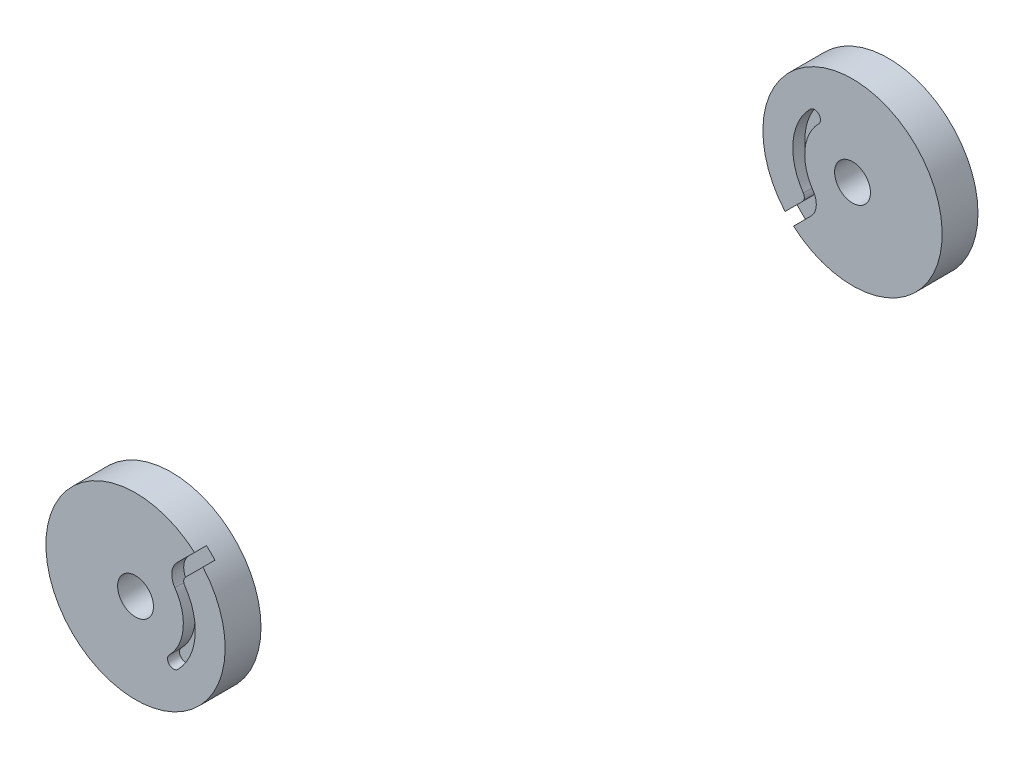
ISO-10303-21;
HEADER;
FILE_DESCRIPTION(('STEP AP214'),'2;1');
FILE_NAME('part.step','',(''),(''),'','','');
FILE_SCHEMA(('AUTOMOTIVE_DESIGN { 1 0 10303 214 1 1 1 1 }'));
ENDSEC;
DATA;
#1=APPLICATION_CONTEXT('core data for automotive mechanical design processes');
#2=APPLICATION_PROTOCOL_DEFINITION('international standard','automotive_design',2000,#1);
#3=PRODUCT_CONTEXT('',#1,'mechanical');
#4=PRODUCT('Part','Part','',(#3));
#5=PRODUCT_RELATED_PRODUCT_CATEGORY('part','',(#4));
#6=PRODUCT_DEFINITION_FORMATION('','',#4);
#7=PRODUCT_DEFINITION_CONTEXT('part definition',#1,'design');
#8=PRODUCT_DEFINITION('design','',#6,#7);
#9=PRODUCT_DEFINITION_SHAPE('','',#8);
#10=(LENGTH_UNIT() NAMED_UNIT(*) SI_UNIT(.MILLI.,.METRE.));
#11=(NAMED_UNIT(*) PLANE_ANGLE_UNIT() SI_UNIT($,.RADIAN.));
#12=(NAMED_UNIT(*) SI_UNIT($,.STERADIAN.) SOLID_ANGLE_UNIT());
#13=UNCERTAINTY_MEASURE_WITH_UNIT(LENGTH_MEASURE(1.E-05),#10,'distance_accuracy_value','');
#14=(GEOMETRIC_REPRESENTATION_CONTEXT(3) GLOBAL_UNCERTAINTY_ASSIGNED_CONTEXT((#13)) GLOBAL_UNIT_ASSIGNED_CONTEXT((#10,
#11,#12)) REPRESENTATION_CONTEXT('',''));
#15=CARTESIAN_POINT('',(0.,0.,0.));
#16=DIRECTION('',(0.,0.,1.));
#17=DIRECTION('',(1.,0.,0.));
#18=AXIS2_PLACEMENT_3D('',#15,#16,#17);
#19=CARTESIAN_POINT('',(120.,120.,6.));
#20=DIRECTION('',(0.,0.,1.));
#21=DIRECTION('',(1.,0.,0.));
#22=AXIS2_PLACEMENT_3D('',#19,#20,#21);
#23=PLANE('',#22);
#24=DIRECTION('',(0.707106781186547,0.707106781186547,0.));
#25=VECTOR('',#24,1.);
#26=CARTESIAN_POINT('',(113.058577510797,111.644363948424,6.));
#27=LINE('',#26,#25);
#28=CARTESIAN_POINT('',(110.124101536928,108.709887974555,6.));
#29=VERTEX_POINT('',#28);
#30=CARTESIAN_POINT('',(113.058577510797,111.644363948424,6.));
#31=VERTEX_POINT('',#30);
#32=EDGE_CURVE('E123',#29,#31,#27,.T.);
#33=ORIENTED_EDGE('',*,*,#32,.F.);
#34=CARTESIAN_POINT('',(120.,120.,6.));
#35=DIRECTION('',(0.,0.,1.));
#36=DIRECTION('',(1.,0.,0.));
#37=AXIS2_PLACEMENT_3D('',#34,#35,#36);
#38=CIRCLE('',#37,15.);
#39=CARTESIAN_POINT('',(108.709887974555,110.124101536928,6.));
#40=VERTEX_POINT('',#39);
#41=EDGE_CURVE('E122',#29,#40,#38,.T.);
#42=ORIENTED_EDGE('',*,*,#41,.T.);
#43=DIRECTION('',(-0.707106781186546,-0.707106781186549,0.));
#44=VECTOR('',#43,1.);
#45=CARTESIAN_POINT('',(107.355586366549,108.769799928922,6.));
#46=LINE('',#45,#44);
#47=CARTESIAN_POINT('',(111.644363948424,113.058577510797,6.));
#48=VERTEX_POINT('',#47);
#49=EDGE_CURVE('E103',#48,#40,#46,.T.);
#50=ORIENTED_EDGE('',*,*,#49,.F.);
#51=CARTESIAN_POINT('',(110.937257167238,113.765684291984,6.));
#52=DIRECTION('',(0.,0.,-1.));
#53=DIRECTION('',(-1.,0.,0.));
#54=AXIS2_PLACEMENT_3D('',#51,#52,#53);
#55=CIRCLE('',#54,0.999999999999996);
#56=CARTESIAN_POINT('',(111.761142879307,114.33244026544,6.));
#57=VERTEX_POINT('',#56);
#58=EDGE_CURVE('E111',#57,#48,#55,.T.);
#59=ORIENTED_EDGE('',*,*,#58,.F.);
#60=CARTESIAN_POINT('',(120.,120.,6.));
#61=DIRECTION('',(0.,0.,1.));
#62=DIRECTION('',(1.,0.,0.));
#63=AXIS2_PLACEMENT_3D('',#60,#61,#62);
#64=CIRCLE('',#63,10.);
#65=CARTESIAN_POINT('',(112.928932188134,127.071067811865,6.));
#66=VERTEX_POINT('',#65);
#67=EDGE_CURVE('E136',#66,#57,#64,.T.);
#68=ORIENTED_EDGE('',*,*,#67,.F.);
#69=CARTESIAN_POINT('',(113.636038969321,126.363961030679,6.));
#70=DIRECTION('',(0.,0.,1.));
#71=DIRECTION('',(-1.,0.,0.));
#72=AXIS2_PLACEMENT_3D('',#69,#70,#71);
#73=CIRCLE('',#72,1.);
#74=CARTESIAN_POINT('',(114.343145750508,125.656854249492,6.));
#75=VERTEX_POINT('',#74);
#76=EDGE_CURVE('E133',#75,#66,#73,.T.);
#77=ORIENTED_EDGE('',*,*,#76,.F.);
#78=CARTESIAN_POINT('',(120.,120.,6.));
#79=DIRECTION('',(0.,0.,-1.));
#80=DIRECTION('',(1.,0.,0.));
#81=AXIS2_PLACEMENT_3D('',#78,#79,#80);
#82=CIRCLE('',#81,7.99999999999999);
#83=CARTESIAN_POINT('',(113.408914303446,115.465952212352,6.));
#84=VERTEX_POINT('',#83);
#85=EDGE_CURVE('E130',#84,#75,#82,.T.);
#86=ORIENTED_EDGE('',*,*,#85,.F.);
#87=CARTESIAN_POINT('',(110.937257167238,113.765684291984,6.));
#88=DIRECTION('',(0.,0.,1.));
#89=DIRECTION('',(1.,0.,0.));
#90=AXIS2_PLACEMENT_3D('',#87,#88,#89);
#91=CIRCLE('',#90,2.99999999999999);
#92=EDGE_CURVE('E125',#31,#84,#91,.T.);
#93=ORIENTED_EDGE('',*,*,#92,.F.);
#94=EDGE_LOOP('',(#33,#42,#50,#59,#68,#77,#86,#93));
#95=FACE_BOUND('',#94,.T.);
#96=CARTESIAN_POINT('',(120.,120.,6.));
#97=DIRECTION('',(0.,0.,1.));
#98=DIRECTION('',(1.,0.,0.));
#99=AXIS2_PLACEMENT_3D('',#96,#97,#98);
#100=CIRCLE('',#99,3.00000000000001);
#101=CARTESIAN_POINT('',(123.,120.,6.));
#102=VERTEX_POINT('',#101);
#103=EDGE_CURVE('E166',#102,#102,#100,.T.);
#104=ORIENTED_EDGE('',*,*,#103,.F.);
#105=EDGE_LOOP('',(#104));
#106=FACE_BOUND('',#105,.T.);
#107=ADVANCED_FACE('F36',(#95,#106),#23,.T.);
#108=CARTESIAN_POINT('',(120.,120.,0.));
#109=DIRECTION('',(0.,0.,1.));
#110=DIRECTION('',(1.,0.,0.));
#111=AXIS2_PLACEMENT_3D('',#108,#109,#110);
#112=PLANE('',#111);
#113=CARTESIAN_POINT('',(120.,120.,0.));
#114=DIRECTION('',(0.,0.,1.));
#115=DIRECTION('',(1.,0.,0.));
#116=AXIS2_PLACEMENT_3D('',#113,#114,#115);
#117=CIRCLE('',#116,15.);
#118=CARTESIAN_POINT('',(135.,120.,0.));
#119=VERTEX_POINT('',#118);
#120=EDGE_CURVE('E169',#119,#119,#117,.T.);
#121=ORIENTED_EDGE('',*,*,#120,.F.);
#122=EDGE_LOOP('',(#121));
#123=FACE_BOUND('',#122,.T.);
#124=CARTESIAN_POINT('',(120.,120.,0.));
#125=DIRECTION('',(0.,0.,1.));
#126=DIRECTION('',(1.,0.,0.));
#127=AXIS2_PLACEMENT_3D('',#124,#125,#126);
#128=CIRCLE('',#127,3.00000000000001);
#129=CARTESIAN_POINT('',(123.,120.,0.));
#130=VERTEX_POINT('',#129);
#131=EDGE_CURVE('E155',#130,#130,#128,.T.);
#132=ORIENTED_EDGE('',*,*,#131,.T.);
#133=EDGE_LOOP('',(#132));
#134=FACE_BOUND('',#133,.T.);
#135=ADVANCED_FACE('F204',(#123,#134),#112,.F.);
#136=CARTESIAN_POINT('',(120.,120.,6.));
#137=DIRECTION('',(0.,0.,-1.));
#138=DIRECTION('',(-1.,0.,0.));
#139=AXIS2_PLACEMENT_3D('',#136,#137,#138);
#140=CYLINDRICAL_SURFACE('',#139,15.);
#141=ORIENTED_EDGE('',*,*,#41,.F.);
#142=DIRECTION('',(0.,0.,-1.));
#143=VECTOR('',#142,1.);
#144=CARTESIAN_POINT('',(110.124101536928,108.709887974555,6.));
#145=LINE('',#144,#143);
#146=CARTESIAN_POINT('',(110.124101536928,108.709887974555,4.));
#147=VERTEX_POINT('',#146);
#148=EDGE_CURVE('E12',#29,#147,#145,.T.);
#149=ORIENTED_EDGE('',*,*,#148,.T.);
#150=CARTESIAN_POINT('',(120.,120.,4.));
#151=DIRECTION('',(0.,0.,-1.));
#152=DIRECTION('',(-1.,0.,0.));
#153=AXIS2_PLACEMENT_3D('',#150,#151,#152);
#154=CIRCLE('',#153,15.);
#155=CARTESIAN_POINT('',(108.709887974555,110.124101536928,4.));
#156=VERTEX_POINT('',#155);
#157=EDGE_CURVE('E56',#147,#156,#154,.T.);
#158=ORIENTED_EDGE('',*,*,#157,.T.);
#159=DIRECTION('',(0.,0.,-1.));
#160=VECTOR('',#159,1.);
#161=CARTESIAN_POINT('',(108.709887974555,110.124101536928,6.));
#162=LINE('',#161,#160);
#163=EDGE_CURVE('E44',#156,#40,#162,.F.);
#164=ORIENTED_EDGE('',*,*,#163,.T.);
#165=EDGE_LOOP('',(#141,#149,#158,#164));
#166=FACE_BOUND('',#165,.T.);
#167=ORIENTED_EDGE('',*,*,#120,.T.);
#168=EDGE_LOOP('',(#167));
#169=FACE_BOUND('',#168,.T.);
#170=ADVANCED_FACE('F38',(#166,#169),#140,.T.);
#171=CARTESIAN_POINT('',(120.,120.,6.));
#172=DIRECTION('',(0.,0.,-1.));
#173=DIRECTION('',(-1.,0.,0.));
#174=AXIS2_PLACEMENT_3D('',#171,#172,#173);
#175=CYLINDRICAL_SURFACE('',#174,3.00000000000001);
#176=ORIENTED_EDGE('',*,*,#103,.T.);
#177=EDGE_LOOP('',(#176));
#178=FACE_BOUND('',#177,.T.);
#179=ORIENTED_EDGE('',*,*,#131,.F.);
#180=EDGE_LOOP('',(#179));
#181=FACE_BOUND('',#180,.T.);
#182=ADVANCED_FACE('F213',(#178,#181),#175,.F.);
#183=CARTESIAN_POINT('',(113.058577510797,111.644363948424,4.));
#184=DIRECTION('',(0.707106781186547,-0.707106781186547,0.));
#185=DIRECTION('',(0.707106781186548,0.707106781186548,0.));
#186=AXIS2_PLACEMENT_3D('',#183,#184,#185);
#187=PLANE('',#186);
#188=ORIENTED_EDGE('',*,*,#32,.T.);
#189=DIRECTION('',(0.,0.,1.));
#190=VECTOR('',#189,1.);
#191=CARTESIAN_POINT('',(113.058577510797,111.644363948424,4.));
#192=LINE('',#191,#190);
#193=CARTESIAN_POINT('',(113.058577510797,111.644363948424,4.));
#194=VERTEX_POINT('',#193);
#195=EDGE_CURVE('E107',#194,#31,#192,.T.);
#196=ORIENTED_EDGE('',*,*,#195,.F.);
#197=DIRECTION('',(0.707106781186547,0.707106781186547,0.));
#198=VECTOR('',#197,1.);
#199=CARTESIAN_POINT('',(113.058577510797,111.644363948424,4.));
#200=LINE('',#199,#198);
#201=EDGE_CURVE('E141',#147,#194,#200,.T.);
#202=ORIENTED_EDGE('',*,*,#201,.F.);
#203=ORIENTED_EDGE('',*,*,#148,.F.);
#204=EDGE_LOOP('',(#188,#196,#202,#203));
#205=FACE_BOUND('',#204,.T.);
#206=ADVANCED_FACE('F176',(#205),#187,.F.);
#207=CARTESIAN_POINT('',(107.355586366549,108.769799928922,4.));
#208=DIRECTION('',(-0.707106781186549,0.707106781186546,0.));
#209=DIRECTION('',(-0.707106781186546,-0.707106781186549,0.));
#210=AXIS2_PLACEMENT_3D('',#207,#208,#209);
#211=PLANE('',#210);
#212=DIRECTION('',(-0.707106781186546,-0.707106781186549,0.));
#213=VECTOR('',#212,1.);
#214=CARTESIAN_POINT('',(107.355586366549,108.769799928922,4.));
#215=LINE('',#214,#213);
#216=CARTESIAN_POINT('',(111.644363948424,113.058577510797,4.));
#217=VERTEX_POINT('',#216);
#218=EDGE_CURVE('E51',#217,#156,#215,.T.);
#219=ORIENTED_EDGE('',*,*,#218,.F.);
#220=DIRECTION('',(0.,0.,1.));
#221=VECTOR('',#220,1.);
#222=CARTESIAN_POINT('',(111.644363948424,113.058577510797,4.));
#223=LINE('',#222,#221);
#224=EDGE_CURVE('E99',#217,#48,#223,.T.);
#225=ORIENTED_EDGE('',*,*,#224,.T.);
#226=ORIENTED_EDGE('',*,*,#49,.T.);
#227=ORIENTED_EDGE('',*,*,#163,.F.);
#228=EDGE_LOOP('',(#219,#225,#226,#227));
#229=FACE_BOUND('',#228,.T.);
#230=ADVANCED_FACE('F101',(#229),#211,.F.);
#231=CARTESIAN_POINT('',(110.937257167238,113.765684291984,4.));
#232=DIRECTION('',(0.,0.,-1.));
#233=DIRECTION('',(-1.,0.,0.));
#234=AXIS2_PLACEMENT_3D('',#231,#232,#233);
#235=PLANE('',#234);
#236=ORIENTED_EDGE('',*,*,#201,.T.);
#237=CARTESIAN_POINT('',(110.937257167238,113.765684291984,4.));
#238=DIRECTION('',(0.,0.,1.));
#239=DIRECTION('',(1.,0.,0.));
#240=AXIS2_PLACEMENT_3D('',#237,#238,#239);
#241=CIRCLE('',#240,2.99999999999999);
#242=CARTESIAN_POINT('',(113.408914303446,115.465952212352,4.));
#243=VERTEX_POINT('',#242);
#244=EDGE_CURVE('E143',#194,#243,#241,.T.);
#245=ORIENTED_EDGE('',*,*,#244,.T.);
#246=CARTESIAN_POINT('',(120.,120.,4.));
#247=DIRECTION('',(0.,0.,-1.));
#248=DIRECTION('',(1.,0.,0.));
#249=AXIS2_PLACEMENT_3D('',#246,#247,#248);
#250=CIRCLE('',#249,7.99999999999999);
#251=CARTESIAN_POINT('',(114.343145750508,125.656854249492,4.));
#252=VERTEX_POINT('',#251);
#253=EDGE_CURVE('E146',#243,#252,#250,.T.);
#254=ORIENTED_EDGE('',*,*,#253,.T.);
#255=CARTESIAN_POINT('',(113.636038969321,126.363961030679,4.));
#256=DIRECTION('',(0.,0.,1.));
#257=DIRECTION('',(-1.,0.,0.));
#258=AXIS2_PLACEMENT_3D('',#255,#256,#257);
#259=CIRCLE('',#258,1.);
#260=CARTESIAN_POINT('',(112.928932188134,127.071067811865,4.));
#261=VERTEX_POINT('',#260);
#262=EDGE_CURVE('E149',#252,#261,#259,.T.);
#263=ORIENTED_EDGE('',*,*,#262,.T.);
#264=CARTESIAN_POINT('',(120.,120.,4.));
#265=DIRECTION('',(0.,0.,1.));
#266=DIRECTION('',(1.,0.,0.));
#267=AXIS2_PLACEMENT_3D('',#264,#265,#266);
#268=CIRCLE('',#267,10.);
#269=CARTESIAN_POINT('',(111.761142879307,114.33244026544,4.));
#270=VERTEX_POINT('',#269);
#271=EDGE_CURVE('E108',#261,#270,#268,.T.);
#272=ORIENTED_EDGE('',*,*,#271,.T.);
#273=CARTESIAN_POINT('',(110.937257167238,113.765684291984,4.));
#274=DIRECTION('',(0.,0.,-1.));
#275=DIRECTION('',(-1.,0.,0.));
#276=AXIS2_PLACEMENT_3D('',#273,#274,#275);
#277=CIRCLE('',#276,0.999999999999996);
#278=EDGE_CURVE('E138',#270,#217,#277,.T.);
#279=ORIENTED_EDGE('',*,*,#278,.T.);
#280=ORIENTED_EDGE('',*,*,#218,.T.);
#281=ORIENTED_EDGE('',*,*,#157,.F.);
#282=EDGE_LOOP('',(#236,#245,#254,#263,#272,#279,#280,#281));
#283=FACE_BOUND('',#282,.T.);
#284=ADVANCED_FACE('F185',(#283),#235,.F.);
#285=CARTESIAN_POINT('',(110.937257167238,113.765684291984,4.));
#286=DIRECTION('',(0.,0.,1.));
#287=DIRECTION('',(1.,0.,0.));
#288=AXIS2_PLACEMENT_3D('',#285,#286,#287);
#289=CYLINDRICAL_SURFACE('',#288,0.999999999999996);
#290=ORIENTED_EDGE('',*,*,#58,.T.);
#291=ORIENTED_EDGE('',*,*,#224,.F.);
#292=ORIENTED_EDGE('',*,*,#278,.F.);
#293=DIRECTION('',(0.,0.,1.));
#294=VECTOR('',#293,1.);
#295=CARTESIAN_POINT('',(111.761142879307,114.33244026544,4.));
#296=LINE('',#295,#294);
#297=EDGE_CURVE('E113',#270,#57,#296,.T.);
#298=ORIENTED_EDGE('',*,*,#297,.T.);
#299=EDGE_LOOP('',(#290,#291,#292,#298));
#300=FACE_BOUND('',#299,.T.);
#301=ADVANCED_FACE('F112',(#300),#289,.T.);
#302=CARTESIAN_POINT('',(120.,120.,4.));
#303=DIRECTION('',(0.,0.,1.));
#304=DIRECTION('',(1.,0.,0.));
#305=AXIS2_PLACEMENT_3D('',#302,#303,#304);
#306=CYLINDRICAL_SURFACE('',#305,10.);
#307=ORIENTED_EDGE('',*,*,#67,.T.);
#308=ORIENTED_EDGE('',*,*,#297,.F.);
#309=ORIENTED_EDGE('',*,*,#271,.F.);
#310=DIRECTION('',(0.,0.,1.));
#311=VECTOR('',#310,1.);
#312=CARTESIAN_POINT('',(112.928932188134,127.071067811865,4.));
#313=LINE('',#312,#311);
#314=EDGE_CURVE('E156',#261,#66,#313,.T.);
#315=ORIENTED_EDGE('',*,*,#314,.T.);
#316=EDGE_LOOP('',(#307,#308,#309,#315));
#317=FACE_BOUND('',#316,.T.);
#318=ADVANCED_FACE('F193',(#317),#306,.F.);
#319=CARTESIAN_POINT('',(113.636038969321,126.363961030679,4.));
#320=DIRECTION('',(0.,0.,1.));
#321=DIRECTION('',(1.,0.,0.));
#322=AXIS2_PLACEMENT_3D('',#319,#320,#321);
#323=CYLINDRICAL_SURFACE('',#322,1.);
#324=ORIENTED_EDGE('',*,*,#76,.T.);
#325=ORIENTED_EDGE('',*,*,#314,.F.);
#326=ORIENTED_EDGE('',*,*,#262,.F.);
#327=DIRECTION('',(0.,0.,1.));
#328=VECTOR('',#327,1.);
#329=CARTESIAN_POINT('',(114.343145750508,125.656854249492,4.));
#330=LINE('',#329,#328);
#331=EDGE_CURVE('E158',#252,#75,#330,.T.);
#332=ORIENTED_EDGE('',*,*,#331,.T.);
#333=EDGE_LOOP('',(#324,#325,#326,#332));
#334=FACE_BOUND('',#333,.T.);
#335=ADVANCED_FACE('F191',(#334),#323,.F.);
#336=CARTESIAN_POINT('',(120.,120.,4.));
#337=DIRECTION('',(0.,0.,1.));
#338=DIRECTION('',(1.,0.,0.));
#339=AXIS2_PLACEMENT_3D('',#336,#337,#338);
#340=CYLINDRICAL_SURFACE('',#339,7.99999999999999);
#341=ORIENTED_EDGE('',*,*,#85,.T.);
#342=ORIENTED_EDGE('',*,*,#331,.F.);
#343=ORIENTED_EDGE('',*,*,#253,.F.);
#344=DIRECTION('',(0.,0.,1.));
#345=VECTOR('',#344,1.);
#346=CARTESIAN_POINT('',(113.408914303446,115.465952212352,4.));
#347=LINE('',#346,#345);
#348=EDGE_CURVE('E160',#243,#84,#347,.T.);
#349=ORIENTED_EDGE('',*,*,#348,.T.);
#350=EDGE_LOOP('',(#341,#342,#343,#349));
#351=FACE_BOUND('',#350,.T.);
#352=ADVANCED_FACE('F189',(#351),#340,.T.);
#353=CARTESIAN_POINT('',(110.937257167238,113.765684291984,4.));
#354=DIRECTION('',(0.,0.,1.));
#355=DIRECTION('',(1.,0.,0.));
#356=AXIS2_PLACEMENT_3D('',#353,#354,#355);
#357=CYLINDRICAL_SURFACE('',#356,2.99999999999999);
#358=ORIENTED_EDGE('',*,*,#92,.T.);
#359=ORIENTED_EDGE('',*,*,#348,.F.);
#360=ORIENTED_EDGE('',*,*,#244,.F.);
#361=ORIENTED_EDGE('',*,*,#195,.T.);
#362=EDGE_LOOP('',(#358,#359,#360,#361));
#363=FACE_BOUND('',#362,.T.);
#364=ADVANCED_FACE('F182',(#363),#357,.F.);
#365=CLOSED_SHELL('',(#107,#135,#170,#182,#206,#230,#284,#301,#318,#335,#352,#364));
#366=MANIFOLD_SOLID_BREP('B2',#365);
#367=CARTESIAN_POINT('',(0.,0.,6.));
#368=DIRECTION('',(0.,0.,1.));
#369=DIRECTION('',(1.,0.,0.));
#370=AXIS2_PLACEMENT_3D('',#367,#368,#369);
#371=PLANE('',#370);
#372=DIRECTION('',(-0.707106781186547,-0.707106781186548,0.));
#373=VECTOR('',#372,1.);
#374=CARTESIAN_POINT('',(6.94142248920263,8.35563605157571,6.));
#375=LINE('',#374,#373);
#376=CARTESIAN_POINT('',(9.87589846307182,11.2901120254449,6.));
#377=VERTEX_POINT('',#376);
#378=CARTESIAN_POINT('',(6.94142248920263,8.35563605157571,6.));
#379=VERTEX_POINT('',#378);
#380=EDGE_CURVE('E362',#377,#379,#375,.T.);
#381=ORIENTED_EDGE('',*,*,#380,.F.);
#382=CARTESIAN_POINT('',(0.,0.,6.));
#383=DIRECTION('',(0.,0.,1.));
#384=DIRECTION('',(1.,0.,0.));
#385=AXIS2_PLACEMENT_3D('',#382,#383,#384);
#386=CIRCLE('',#385,15.);
#387=CARTESIAN_POINT('',(11.2901120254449,9.87589846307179,6.));
#388=VERTEX_POINT('',#387);
#389=EDGE_CURVE('E361',#377,#388,#386,.T.);
#390=ORIENTED_EDGE('',*,*,#389,.T.);
#391=DIRECTION('',(0.707106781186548,0.707106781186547,0.));
#392=VECTOR('',#391,1.);
#393=CARTESIAN_POINT('',(12.5831905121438,11.1689769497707,6.));
#394=LINE('',#393,#392);
#395=CARTESIAN_POINT('',(8.35563605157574,6.9414224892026,6.));
#396=VERTEX_POINT('',#395);
#397=EDGE_CURVE('E342',#396,#388,#394,.T.);
#398=ORIENTED_EDGE('',*,*,#397,.F.);
#399=CARTESIAN_POINT('',(9.06274283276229,6.23431570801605,6.));
#400=DIRECTION('',(0.,0.,-1.));
#401=DIRECTION('',(1.,0.,0.));
#402=AXIS2_PLACEMENT_3D('',#399,#400,#401);
#403=CIRCLE('',#402,1.);
#404=CARTESIAN_POINT('',(8.23885712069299,5.66755973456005,6.));
#405=VERTEX_POINT('',#404);
#406=EDGE_CURVE('E350',#405,#396,#403,.T.);
#407=ORIENTED_EDGE('',*,*,#406,.F.);
#408=CARTESIAN_POINT('',(0.,0.,6.));
#409=DIRECTION('',(0.,0.,1.));
#410=DIRECTION('',(1.,0.,0.));
#411=AXIS2_PLACEMENT_3D('',#408,#409,#410);
#412=CIRCLE('',#411,10.);
#413=CARTESIAN_POINT('',(7.07106781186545,-7.0710678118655,6.));
#414=VERTEX_POINT('',#413);
#415=EDGE_CURVE('E375',#414,#405,#412,.T.);
#416=ORIENTED_EDGE('',*,*,#415,.F.);
#417=CARTESIAN_POINT('',(6.3639610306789,-6.36396103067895,6.));
#418=DIRECTION('',(0.,0.,1.));
#419=DIRECTION('',(1.,0.,0.));
#420=AXIS2_PLACEMENT_3D('',#417,#418,#419);
#421=CIRCLE('',#420,0.999999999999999);
#422=CARTESIAN_POINT('',(5.65685424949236,-5.6568542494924,6.));
#423=VERTEX_POINT('',#422);
#424=EDGE_CURVE('E372',#423,#414,#421,.T.);
#425=ORIENTED_EDGE('',*,*,#424,.F.);
#426=CARTESIAN_POINT('',(0.,0.,6.));
#427=DIRECTION('',(0.,0.,-1.));
#428=DIRECTION('',(1.,0.,0.));
#429=AXIS2_PLACEMENT_3D('',#426,#427,#428);
#430=CIRCLE('',#429,8.);
#431=CARTESIAN_POINT('',(6.5910856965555,4.53404778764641,6.));
#432=VERTEX_POINT('',#431);
#433=EDGE_CURVE('E369',#432,#423,#430,.T.);
#434=ORIENTED_EDGE('',*,*,#433,.F.);
#435=CARTESIAN_POINT('',(9.06274283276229,6.23431570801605,6.));
#436=DIRECTION('',(0.,0.,1.));
#437=DIRECTION('',(1.,0.,0.));
#438=AXIS2_PLACEMENT_3D('',#435,#436,#437);
#439=CIRCLE('',#438,3.00000000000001);
#440=EDGE_CURVE('E364',#379,#432,#439,.T.);
#441=ORIENTED_EDGE('',*,*,#440,.F.);
#442=EDGE_LOOP('',(#381,#390,#398,#407,#416,#425,#434,#441));
#443=FACE_BOUND('',#442,.T.);
#444=CARTESIAN_POINT('',(0.,0.,6.));
#445=DIRECTION('',(0.,0.,1.));
#446=DIRECTION('',(1.,0.,0.));
#447=AXIS2_PLACEMENT_3D('',#444,#445,#446);
#448=CIRCLE('',#447,3.);
#449=CARTESIAN_POINT('',(3.,0.,6.));
#450=VERTEX_POINT('',#449);
#451=EDGE_CURVE('E405',#450,#450,#448,.T.);
#452=ORIENTED_EDGE('',*,*,#451,.F.);
#453=EDGE_LOOP('',(#452));
#454=FACE_BOUND('',#453,.T.);
#455=ADVANCED_FACE('F275',(#443,#454),#371,.T.);
#456=CARTESIAN_POINT('',(0.,0.,0.));
#457=DIRECTION('',(0.,0.,1.));
#458=DIRECTION('',(1.,0.,0.));
#459=AXIS2_PLACEMENT_3D('',#456,#457,#458);
#460=PLANE('',#459);
#461=CARTESIAN_POINT('',(0.,0.,0.));
#462=DIRECTION('',(0.,0.,1.));
#463=DIRECTION('',(1.,0.,0.));
#464=AXIS2_PLACEMENT_3D('',#461,#462,#463);
#465=CIRCLE('',#464,15.);
#466=CARTESIAN_POINT('',(15.,0.,0.));
#467=VERTEX_POINT('',#466);
#468=EDGE_CURVE('E408',#467,#467,#465,.T.);
#469=ORIENTED_EDGE('',*,*,#468,.F.);
#470=EDGE_LOOP('',(#469));
#471=FACE_BOUND('',#470,.T.);
#472=CARTESIAN_POINT('',(0.,0.,0.));
#473=DIRECTION('',(0.,0.,1.));
#474=DIRECTION('',(1.,0.,0.));
#475=AXIS2_PLACEMENT_3D('',#472,#473,#474);
#476=CIRCLE('',#475,3.);
#477=CARTESIAN_POINT('',(3.,0.,0.));
#478=VERTEX_POINT('',#477);
#479=EDGE_CURVE('E394',#478,#478,#476,.T.);
#480=ORIENTED_EDGE('',*,*,#479,.T.);
#481=EDGE_LOOP('',(#480));
#482=FACE_BOUND('',#481,.T.);
#483=ADVANCED_FACE('F443',(#471,#482),#460,.F.);
#484=CARTESIAN_POINT('',(0.,0.,6.));
#485=DIRECTION('',(0.,0.,-1.));
#486=DIRECTION('',(-1.,0.,0.));
#487=AXIS2_PLACEMENT_3D('',#484,#485,#486);
#488=CYLINDRICAL_SURFACE('',#487,15.);
#489=ORIENTED_EDGE('',*,*,#389,.F.);
#490=DIRECTION('',(0.,0.,-1.));
#491=VECTOR('',#490,1.);
#492=CARTESIAN_POINT('',(9.87589846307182,11.2901120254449,6.));
#493=LINE('',#492,#491);
#494=CARTESIAN_POINT('',(9.87589846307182,11.2901120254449,4.));
#495=VERTEX_POINT('',#494);
#496=EDGE_CURVE('E34',#377,#495,#493,.T.);
#497=ORIENTED_EDGE('',*,*,#496,.T.);
#498=CARTESIAN_POINT('',(0.,0.,4.));
#499=DIRECTION('',(0.,0.,1.));
#500=DIRECTION('',(1.,0.,0.));
#501=AXIS2_PLACEMENT_3D('',#498,#499,#500);
#502=CIRCLE('',#501,15.);
#503=CARTESIAN_POINT('',(11.2901120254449,9.87589846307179,4.));
#504=VERTEX_POINT('',#503);
#505=EDGE_CURVE('E295',#504,#495,#502,.T.);
#506=ORIENTED_EDGE('',*,*,#505,.F.);
#507=DIRECTION('',(0.,0.,-1.));
#508=VECTOR('',#507,1.);
#509=CARTESIAN_POINT('',(11.2901120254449,9.87589846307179,6.));
#510=LINE('',#509,#508);
#511=EDGE_CURVE('E283',#504,#388,#510,.F.);
#512=ORIENTED_EDGE('',*,*,#511,.T.);
#513=EDGE_LOOP('',(#489,#497,#506,#512));
#514=FACE_BOUND('',#513,.T.);
#515=ORIENTED_EDGE('',*,*,#468,.T.);
#516=EDGE_LOOP('',(#515));
#517=FACE_BOUND('',#516,.T.);
#518=ADVANCED_FACE('F277',(#514,#517),#488,.T.);
#519=CARTESIAN_POINT('',(0.,0.,6.));
#520=DIRECTION('',(0.,0.,-1.));
#521=DIRECTION('',(-1.,0.,0.));
#522=AXIS2_PLACEMENT_3D('',#519,#520,#521);
#523=CYLINDRICAL_SURFACE('',#522,3.);
#524=ORIENTED_EDGE('',*,*,#451,.T.);
#525=EDGE_LOOP('',(#524));
#526=FACE_BOUND('',#525,.T.);
#527=ORIENTED_EDGE('',*,*,#479,.F.);
#528=EDGE_LOOP('',(#527));
#529=FACE_BOUND('',#528,.T.);
#530=ADVANCED_FACE('F452',(#526,#529),#523,.F.);
#531=CARTESIAN_POINT('',(6.94142248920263,8.35563605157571,4.));
#532=DIRECTION('',(-0.707106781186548,0.707106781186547,0.));
#533=DIRECTION('',(-0.707106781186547,-0.707106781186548,0.));
#534=AXIS2_PLACEMENT_3D('',#531,#532,#533);
#535=PLANE('',#534);
#536=ORIENTED_EDGE('',*,*,#380,.T.);
#537=DIRECTION('',(0.,0.,1.));
#538=VECTOR('',#537,1.);
#539=CARTESIAN_POINT('',(6.94142248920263,8.35563605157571,4.));
#540=LINE('',#539,#538);
#541=CARTESIAN_POINT('',(6.94142248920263,8.35563605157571,4.));
#542=VERTEX_POINT('',#541);
#543=EDGE_CURVE('E346',#542,#379,#540,.T.);
#544=ORIENTED_EDGE('',*,*,#543,.F.);
#545=DIRECTION('',(-0.707106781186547,-0.707106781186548,0.));
#546=VECTOR('',#545,1.);
#547=CARTESIAN_POINT('',(6.94142248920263,8.35563605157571,4.));
#548=LINE('',#547,#546);
#549=EDGE_CURVE('E380',#495,#542,#548,.T.);
#550=ORIENTED_EDGE('',*,*,#549,.F.);
#551=ORIENTED_EDGE('',*,*,#496,.F.);
#552=EDGE_LOOP('',(#536,#544,#550,#551));
#553=FACE_BOUND('',#552,.T.);
#554=ADVANCED_FACE('F415',(#553),#535,.F.);
#555=CARTESIAN_POINT('',(12.5831905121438,11.1689769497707,4.));
#556=DIRECTION('',(0.707106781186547,-0.707106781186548,0.));
#557=DIRECTION('',(0.707106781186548,0.707106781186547,0.));
#558=AXIS2_PLACEMENT_3D('',#555,#556,#557);
#559=PLANE('',#558);
#560=DIRECTION('',(0.707106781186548,0.707106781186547,0.));
#561=VECTOR('',#560,1.);
#562=CARTESIAN_POINT('',(12.5831905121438,11.1689769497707,4.));
#563=LINE('',#562,#561);
#564=CARTESIAN_POINT('',(8.35563605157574,6.9414224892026,4.));
#565=VERTEX_POINT('',#564);
#566=EDGE_CURVE('E290',#565,#504,#563,.T.);
#567=ORIENTED_EDGE('',*,*,#566,.F.);
#568=DIRECTION('',(0.,0.,1.));
#569=VECTOR('',#568,1.);
#570=CARTESIAN_POINT('',(8.35563605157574,6.9414224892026,4.));
#571=LINE('',#570,#569);
#572=EDGE_CURVE('E338',#565,#396,#571,.T.);
#573=ORIENTED_EDGE('',*,*,#572,.T.);
#574=ORIENTED_EDGE('',*,*,#397,.T.);
#575=ORIENTED_EDGE('',*,*,#511,.F.);
#576=EDGE_LOOP('',(#567,#573,#574,#575));
#577=FACE_BOUND('',#576,.T.);
#578=ADVANCED_FACE('F340',(#577),#559,.F.);
#579=CARTESIAN_POINT('',(9.06274283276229,6.23431570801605,4.));
#580=DIRECTION('',(0.,0.,1.));
#581=DIRECTION('',(1.,0.,0.));
#582=AXIS2_PLACEMENT_3D('',#579,#580,#581);
#583=PLANE('',#582);
#584=ORIENTED_EDGE('',*,*,#505,.T.);
#585=ORIENTED_EDGE('',*,*,#549,.T.);
#586=CARTESIAN_POINT('',(9.06274283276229,6.23431570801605,4.));
#587=DIRECTION('',(0.,0.,1.));
#588=DIRECTION('',(1.,0.,0.));
#589=AXIS2_PLACEMENT_3D('',#586,#587,#588);
#590=CIRCLE('',#589,3.00000000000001);
#591=CARTESIAN_POINT('',(6.5910856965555,4.53404778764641,4.));
#592=VERTEX_POINT('',#591);
#593=EDGE_CURVE('E382',#542,#592,#590,.T.);
#594=ORIENTED_EDGE('',*,*,#593,.T.);
#595=CARTESIAN_POINT('',(0.,0.,4.));
#596=DIRECTION('',(0.,0.,-1.));
#597=DIRECTION('',(1.,0.,0.));
#598=AXIS2_PLACEMENT_3D('',#595,#596,#597);
#599=CIRCLE('',#598,8.);
#600=CARTESIAN_POINT('',(5.65685424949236,-5.6568542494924,4.));
#601=VERTEX_POINT('',#600);
#602=EDGE_CURVE('E385',#592,#601,#599,.T.);
#603=ORIENTED_EDGE('',*,*,#602,.T.);
#604=CARTESIAN_POINT('',(6.3639610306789,-6.36396103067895,4.));
#605=DIRECTION('',(0.,0.,1.));
#606=DIRECTION('',(1.,0.,0.));
#607=AXIS2_PLACEMENT_3D('',#604,#605,#606);
#608=CIRCLE('',#607,0.999999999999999);
#609=CARTESIAN_POINT('',(7.07106781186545,-7.0710678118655,4.));
#610=VERTEX_POINT('',#609);
#611=EDGE_CURVE('E388',#601,#610,#608,.T.);
#612=ORIENTED_EDGE('',*,*,#611,.T.);
#613=CARTESIAN_POINT('',(0.,0.,4.));
#614=DIRECTION('',(0.,0.,1.));
#615=DIRECTION('',(1.,0.,0.));
#616=AXIS2_PLACEMENT_3D('',#613,#614,#615);
#617=CIRCLE('',#616,10.);
#618=CARTESIAN_POINT('',(8.23885712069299,5.66755973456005,4.));
#619=VERTEX_POINT('',#618);
#620=EDGE_CURVE('E347',#610,#619,#617,.T.);
#621=ORIENTED_EDGE('',*,*,#620,.T.);
#622=CARTESIAN_POINT('',(9.06274283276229,6.23431570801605,4.));
#623=DIRECTION('',(0.,0.,-1.));
#624=DIRECTION('',(1.,0.,0.));
#625=AXIS2_PLACEMENT_3D('',#622,#623,#624);
#626=CIRCLE('',#625,1.);
#627=EDGE_CURVE('E377',#619,#565,#626,.T.);
#628=ORIENTED_EDGE('',*,*,#627,.T.);
#629=ORIENTED_EDGE('',*,*,#566,.T.);
#630=EDGE_LOOP('',(#584,#585,#594,#603,#612,#621,#628,#629));
#631=FACE_BOUND('',#630,.T.);
#632=ADVANCED_FACE('F424',(#631),#583,.T.);
#633=CARTESIAN_POINT('',(9.06274283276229,6.23431570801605,4.));
#634=DIRECTION('',(0.,0.,1.));
#635=DIRECTION('',(1.,0.,0.));
#636=AXIS2_PLACEMENT_3D('',#633,#634,#635);
#637=CYLINDRICAL_SURFACE('',#636,1.);
#638=ORIENTED_EDGE('',*,*,#406,.T.);
#639=ORIENTED_EDGE('',*,*,#572,.F.);
#640=ORIENTED_EDGE('',*,*,#627,.F.);
#641=DIRECTION('',(0.,0.,1.));
#642=VECTOR('',#641,1.);
#643=CARTESIAN_POINT('',(8.23885712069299,5.66755973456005,4.));
#644=LINE('',#643,#642);
#645=EDGE_CURVE('E352',#619,#405,#644,.T.);
#646=ORIENTED_EDGE('',*,*,#645,.T.);
#647=EDGE_LOOP('',(#638,#639,#640,#646));
#648=FACE_BOUND('',#647,.T.);
#649=ADVANCED_FACE('F351',(#648),#637,.T.);
#650=CARTESIAN_POINT('',(0.,0.,4.));
#651=DIRECTION('',(0.,0.,1.));
#652=DIRECTION('',(1.,0.,0.));
#653=AXIS2_PLACEMENT_3D('',#650,#651,#652);
#654=CYLINDRICAL_SURFACE('',#653,10.);
#655=ORIENTED_EDGE('',*,*,#415,.T.);
#656=ORIENTED_EDGE('',*,*,#645,.F.);
#657=ORIENTED_EDGE('',*,*,#620,.F.);
#658=DIRECTION('',(0.,0.,1.));
#659=VECTOR('',#658,1.);
#660=CARTESIAN_POINT('',(7.07106781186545,-7.0710678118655,4.));
#661=LINE('',#660,#659);
#662=EDGE_CURVE('E395',#610,#414,#661,.T.);
#663=ORIENTED_EDGE('',*,*,#662,.T.);
#664=EDGE_LOOP('',(#655,#656,#657,#663));
#665=FACE_BOUND('',#664,.T.);
#666=ADVANCED_FACE('F432',(#665),#654,.F.);
#667=CARTESIAN_POINT('',(6.3639610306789,-6.36396103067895,4.));
#668=DIRECTION('',(0.,0.,1.));
#669=DIRECTION('',(1.,0.,0.));
#670=AXIS2_PLACEMENT_3D('',#667,#668,#669);
#671=CYLINDRICAL_SURFACE('',#670,0.999999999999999);
#672=ORIENTED_EDGE('',*,*,#424,.T.);
#673=ORIENTED_EDGE('',*,*,#662,.F.);
#674=ORIENTED_EDGE('',*,*,#611,.F.);
#675=DIRECTION('',(0.,0.,1.));
#676=VECTOR('',#675,1.);
#677=CARTESIAN_POINT('',(5.65685424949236,-5.6568542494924,4.));
#678=LINE('',#677,#676);
#679=EDGE_CURVE('E397',#601,#423,#678,.T.);
#680=ORIENTED_EDGE('',*,*,#679,.T.);
#681=EDGE_LOOP('',(#672,#673,#674,#680));
#682=FACE_BOUND('',#681,.T.);
#683=ADVANCED_FACE('F430',(#682),#671,.F.);
#684=CARTESIAN_POINT('',(0.,0.,4.));
#685=DIRECTION('',(0.,0.,1.));
#686=DIRECTION('',(1.,0.,0.));
#687=AXIS2_PLACEMENT_3D('',#684,#685,#686);
#688=CYLINDRICAL_SURFACE('',#687,8.);
#689=ORIENTED_EDGE('',*,*,#433,.T.);
#690=ORIENTED_EDGE('',*,*,#679,.F.);
#691=ORIENTED_EDGE('',*,*,#602,.F.);
#692=DIRECTION('',(0.,0.,1.));
#693=VECTOR('',#692,1.);
#694=CARTESIAN_POINT('',(6.5910856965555,4.53404778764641,4.));
#695=LINE('',#694,#693);
#696=EDGE_CURVE('E399',#592,#432,#695,.T.);
#697=ORIENTED_EDGE('',*,*,#696,.T.);
#698=EDGE_LOOP('',(#689,#690,#691,#697));
#699=FACE_BOUND('',#698,.T.);
#700=ADVANCED_FACE('F428',(#699),#688,.T.);
#701=CARTESIAN_POINT('',(9.06274283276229,6.23431570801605,4.));
#702=DIRECTION('',(0.,0.,1.));
#703=DIRECTION('',(1.,0.,0.));
#704=AXIS2_PLACEMENT_3D('',#701,#702,#703);
#705=CYLINDRICAL_SURFACE('',#704,3.00000000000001);
#706=ORIENTED_EDGE('',*,*,#440,.T.);
#707=ORIENTED_EDGE('',*,*,#696,.F.);
#708=ORIENTED_EDGE('',*,*,#593,.F.);
#709=ORIENTED_EDGE('',*,*,#543,.T.);
#710=EDGE_LOOP('',(#706,#707,#708,#709));
#711=FACE_BOUND('',#710,.T.);
#712=ADVANCED_FACE('F421',(#711),#705,.F.);
#713=CLOSED_SHELL('',(#455,#483,#518,#530,#554,#578,#632,#649,#666,#683,#700,#712));
#714=MANIFOLD_SOLID_BREP('B6',#713);
#715=ADVANCED_BREP_SHAPE_REPRESENTATION('',(#18,#366,#714),#14);
#716=SHAPE_DEFINITION_REPRESENTATION(#9,#715);
ENDSEC;
END-ISO-10303-21;
